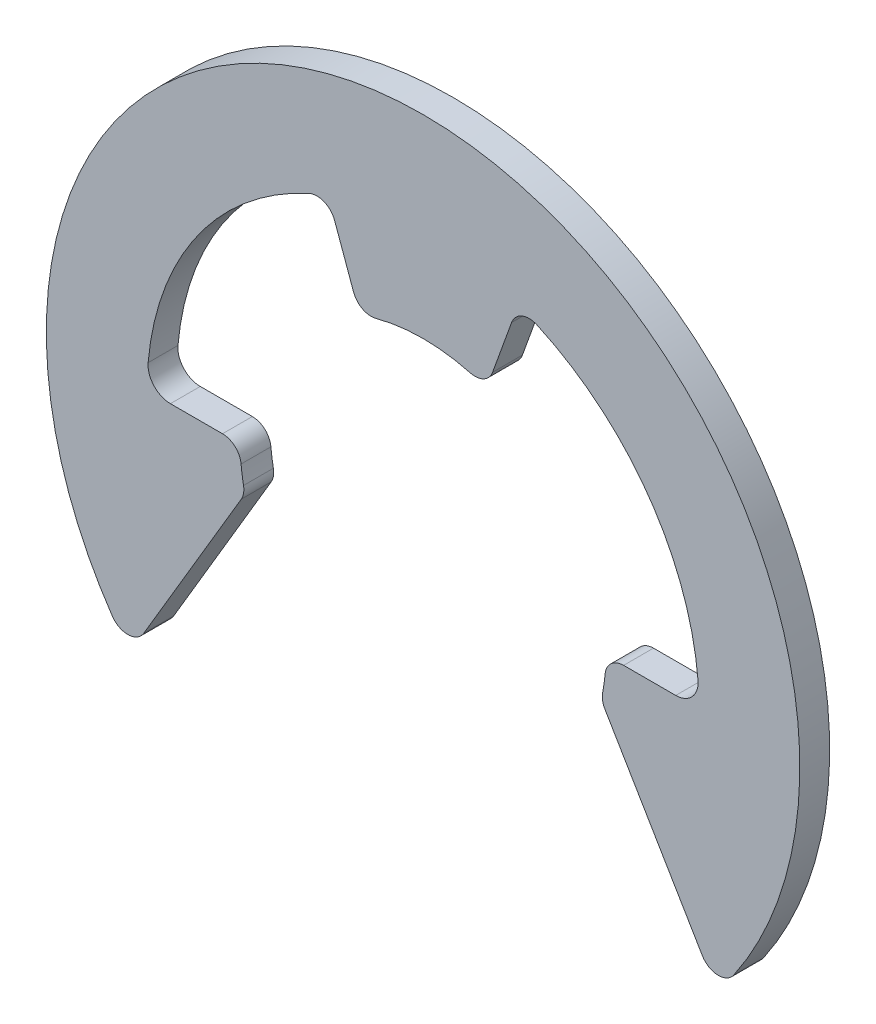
ISO-10303-21;
HEADER;
FILE_DESCRIPTION(('STEP AP214'),'2;1');
FILE_NAME('part.step','',(''),(''),'','','');
FILE_SCHEMA(('AUTOMOTIVE_DESIGN { 1 0 10303 214 1 1 1 1 }'));
ENDSEC;
DATA;
#1=APPLICATION_CONTEXT('core data for automotive mechanical design processes');
#2=APPLICATION_PROTOCOL_DEFINITION('international standard','automotive_design',2000,#1);
#3=PRODUCT_CONTEXT('',#1,'mechanical');
#4=PRODUCT('Part','Part','',(#3));
#5=PRODUCT_RELATED_PRODUCT_CATEGORY('part','',(#4));
#6=PRODUCT_DEFINITION_FORMATION('','',#4);
#7=PRODUCT_DEFINITION_CONTEXT('part definition',#1,'design');
#8=PRODUCT_DEFINITION('design','',#6,#7);
#9=PRODUCT_DEFINITION_SHAPE('','',#8);
#10=(LENGTH_UNIT() NAMED_UNIT(*) SI_UNIT(.MILLI.,.METRE.));
#11=(NAMED_UNIT(*) PLANE_ANGLE_UNIT() SI_UNIT($,.RADIAN.));
#12=(NAMED_UNIT(*) SI_UNIT($,.STERADIAN.) SOLID_ANGLE_UNIT());
#13=UNCERTAINTY_MEASURE_WITH_UNIT(LENGTH_MEASURE(1.E-05),#10,'distance_accuracy_value','');
#14=(GEOMETRIC_REPRESENTATION_CONTEXT(3) GLOBAL_UNCERTAINTY_ASSIGNED_CONTEXT((#13)) GLOBAL_UNIT_ASSIGNED_CONTEXT((#10,
#11,#12)) REPRESENTATION_CONTEXT('',''));
#15=CARTESIAN_POINT('',(0.,0.,0.));
#16=DIRECTION('',(0.,0.,1.));
#17=DIRECTION('',(1.,0.,0.));
#18=AXIS2_PLACEMENT_3D('',#15,#16,#17);
#19=CARTESIAN_POINT('',(0.,0.,-0.4));
#20=DIRECTION('',(0.,0.,1.));
#21=DIRECTION('',(1.,0.,0.));
#22=AXIS2_PLACEMENT_3D('',#19,#20,#21);
#23=CYLINDRICAL_SURFACE('',#22,4.9);
#24=CARTESIAN_POINT('',(0.,0.,0.4));
#25=DIRECTION('',(0.,0.,-1.));
#26=DIRECTION('',(-1.,0.,0.));
#27=AXIS2_PLACEMENT_3D('',#24,#25,#26);
#28=CIRCLE('',#27,4.9);
#29=CARTESIAN_POINT('',(4.87894998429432,-0.453703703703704,0.4));
#30=VERTEX_POINT('',#29);
#31=CARTESIAN_POINT('',(4.81306388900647,-0.91892110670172,0.4));
#32=VERTEX_POINT('',#31);
#33=EDGE_CURVE('E471',#30,#32,#28,.T.);
#34=ORIENTED_EDGE('',*,*,#33,.F.);
#35=DIRECTION('',(0.,0.,1.));
#36=VECTOR('',#35,1.);
#37=CARTESIAN_POINT('',(4.87894998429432,-0.453703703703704,-0.4));
#38=LINE('',#37,#36);
#39=CARTESIAN_POINT('',(4.87894998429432,-0.453703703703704,-0.4));
#40=VERTEX_POINT('',#39);
#41=EDGE_CURVE('E338',#30,#40,#38,.F.);
#42=ORIENTED_EDGE('',*,*,#41,.T.);
#43=CARTESIAN_POINT('',(0.,0.,-0.4));
#44=DIRECTION('',(0.,0.,-1.));
#45=DIRECTION('',(-1.,0.,0.));
#46=AXIS2_PLACEMENT_3D('',#43,#44,#45);
#47=CIRCLE('',#46,4.9);
#48=CARTESIAN_POINT('',(4.81306388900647,-0.91892110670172,-0.4));
#49=VERTEX_POINT('',#48);
#50=EDGE_CURVE('E436',#40,#49,#47,.T.);
#51=ORIENTED_EDGE('',*,*,#50,.T.);
#52=DIRECTION('',(0.,0.,1.));
#53=VECTOR('',#52,1.);
#54=CARTESIAN_POINT('',(4.81306388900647,-0.91892110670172,-0.4));
#55=LINE('',#54,#53);
#56=EDGE_CURVE('E334',#49,#32,#55,.T.);
#57=ORIENTED_EDGE('',*,*,#56,.T.);
#58=EDGE_LOOP('',(#34,#42,#51,#57));
#59=FACE_BOUND('',#58,.T.);
#60=ADVANCED_FACE('F39',(#59),#23,.F.);
#61=CARTESIAN_POINT('',(7.4,0.,-0.4));
#62=DIRECTION('',(0.,1.,0.));
#63=DIRECTION('',(-1.,0.,0.));
#64=AXIS2_PLACEMENT_3D('',#61,#62,#63);
#65=PLANE('',#64);
#66=DIRECTION('',(-1.,0.,0.));
#67=VECTOR('',#66,1.);
#68=CARTESIAN_POINT('',(7.4,0.,-0.4));
#69=LINE('',#68,#67);
#70=CARTESIAN_POINT('',(6.77347768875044,0.,-0.4));
#71=VERTEX_POINT('',#70);
#72=CARTESIAN_POINT('',(5.37680202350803,0.,-0.4));
#73=VERTEX_POINT('',#72);
#74=EDGE_CURVE('E233',#71,#73,#69,.T.);
#75=ORIENTED_EDGE('',*,*,#74,.T.);
#76=DIRECTION('',(0.,0.,1.));
#77=VECTOR('',#76,1.);
#78=CARTESIAN_POINT('',(5.37680202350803,0.,-0.4));
#79=LINE('',#78,#77);
#80=CARTESIAN_POINT('',(5.37680202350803,0.,0.4));
#81=VERTEX_POINT('',#80);
#82=EDGE_CURVE('E312',#73,#81,#79,.T.);
#83=ORIENTED_EDGE('',*,*,#82,.T.);
#84=DIRECTION('',(-1.,0.,0.));
#85=VECTOR('',#84,1.);
#86=CARTESIAN_POINT('',(7.4,0.,0.4));
#87=LINE('',#86,#85);
#88=CARTESIAN_POINT('',(6.77347768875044,0.,0.4));
#89=VERTEX_POINT('',#88);
#90=EDGE_CURVE('E243',#89,#81,#87,.T.);
#91=ORIENTED_EDGE('',*,*,#90,.F.);
#92=DIRECTION('',(0.,0.,-1.));
#93=VECTOR('',#92,1.);
#94=CARTESIAN_POINT('',(6.77347768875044,0.,-0.4));
#95=LINE('',#94,#93);
#96=EDGE_CURVE('E289',#89,#71,#95,.T.);
#97=ORIENTED_EDGE('',*,*,#96,.T.);
#98=EDGE_LOOP('',(#75,#83,#91,#97));
#99=FACE_BOUND('',#98,.T.);
#100=ADVANCED_FACE('F500',(#99),#65,.T.);
#101=CARTESIAN_POINT('',(0.,0.,-0.4));
#102=DIRECTION('',(0.,0.,1.));
#103=DIRECTION('',(1.,0.,0.));
#104=AXIS2_PLACEMENT_3D('',#101,#102,#103);
#105=CYLINDRICAL_SURFACE('',#104,7.4);
#106=CARTESIAN_POINT('',(0.,0.,-0.4));
#107=DIRECTION('',(0.,0.,-1.));
#108=DIRECTION('',(-1.,0.,0.));
#109=AXIS2_PLACEMENT_3D('',#106,#107,#108);
#110=CIRCLE('',#109,7.4);
#111=CARTESIAN_POINT('',(3.04917747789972,6.742589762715,-0.4));
#112=VERTEX_POINT('',#111);
#113=CARTESIAN_POINT('',(7.37113748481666,0.652941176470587,-0.4));
#114=VERTEX_POINT('',#113);
#115=EDGE_CURVE('E240',#112,#114,#110,.T.);
#116=ORIENTED_EDGE('',*,*,#115,.T.);
#117=DIRECTION('',(0.,0.,1.));
#118=VECTOR('',#117,1.);
#119=CARTESIAN_POINT('',(7.37113748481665,0.652941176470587,-0.4));
#120=LINE('',#119,#118);
#121=CARTESIAN_POINT('',(7.37113748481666,0.652941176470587,0.4));
#122=VERTEX_POINT('',#121);
#123=EDGE_CURVE('E285',#114,#122,#120,.T.);
#124=ORIENTED_EDGE('',*,*,#123,.T.);
#125=CARTESIAN_POINT('',(0.,0.,0.4));
#126=DIRECTION('',(0.,0.,-1.));
#127=DIRECTION('',(-1.,0.,0.));
#128=AXIS2_PLACEMENT_3D('',#125,#126,#127);
#129=CIRCLE('',#128,7.4);
#130=CARTESIAN_POINT('',(3.04917747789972,6.742589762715,0.4));
#131=VERTEX_POINT('',#130);
#132=EDGE_CURVE('E214',#131,#122,#129,.T.);
#133=ORIENTED_EDGE('',*,*,#132,.F.);
#134=DIRECTION('',(0.,0.,1.));
#135=VECTOR('',#134,1.);
#136=CARTESIAN_POINT('',(3.04917747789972,6.742589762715,-0.4));
#137=LINE('',#136,#135);
#138=EDGE_CURVE('E223',#131,#112,#137,.F.);
#139=ORIENTED_EDGE('',*,*,#138,.T.);
#140=EDGE_LOOP('',(#116,#124,#133,#139));
#141=FACE_BOUND('',#140,.T.);
#142=ADVANCED_FACE('F505',(#141),#105,.F.);
#143=CARTESIAN_POINT('',(1.7,4.59565011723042,-0.4));
#144=DIRECTION('',(0.940427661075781,-0.33999384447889,0.));
#145=DIRECTION('',(0.33999384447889,0.940427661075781,0.));
#146=AXIS2_PLACEMENT_3D('',#143,#144,#145);
#147=PLANE('',#146);
#148=DIRECTION('',(0.33999384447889,0.940427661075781,0.));
#149=VECTOR('',#148,1.);
#150=CARTESIAN_POINT('',(1.7,4.59565011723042,0.4));
#151=LINE('',#150,#149);
#152=CARTESIAN_POINT('',(1.86325906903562,5.04722695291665,0.4));
#153=VERTEX_POINT('',#152);
#154=CARTESIAN_POINT('',(2.37293814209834,6.45700629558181,0.4));
#155=VERTEX_POINT('',#154);
#156=EDGE_CURVE('E201',#153,#155,#151,.T.);
#157=ORIENTED_EDGE('',*,*,#156,.F.);
#158=DIRECTION('',(0.,0.,1.));
#159=VECTOR('',#158,1.);
#160=CARTESIAN_POINT('',(1.86325906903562,5.04722695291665,-0.4));
#161=LINE('',#160,#159);
#162=CARTESIAN_POINT('',(1.86325906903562,5.04722695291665,-0.4));
#163=VERTEX_POINT('',#162);
#164=EDGE_CURVE('E272',#153,#163,#161,.F.);
#165=ORIENTED_EDGE('',*,*,#164,.T.);
#166=DIRECTION('',(0.33999384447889,0.940427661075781,0.));
#167=VECTOR('',#166,1.);
#168=CARTESIAN_POINT('',(1.7,4.59565011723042,-0.4));
#169=LINE('',#168,#167);
#170=CARTESIAN_POINT('',(2.37293814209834,6.45700629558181,-0.4));
#171=VERTEX_POINT('',#170);
#172=EDGE_CURVE('E230',#163,#171,#169,.T.);
#173=ORIENTED_EDGE('',*,*,#172,.T.);
#174=DIRECTION('',(0.,0.,-1.));
#175=VECTOR('',#174,1.);
#176=CARTESIAN_POINT('',(2.37293814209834,6.45700629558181,0.4));
#177=LINE('',#176,#175);
#178=EDGE_CURVE('E222',#171,#155,#177,.F.);
#179=ORIENTED_EDGE('',*,*,#178,.T.);
#180=EDGE_LOOP('',(#157,#165,#173,#179));
#181=FACE_BOUND('',#180,.T.);
#182=ADVANCED_FACE('F228',(#181),#147,.T.);
#183=CARTESIAN_POINT('',(0.,0.,-0.4));
#184=DIRECTION('',(0.,0.,1.));
#185=DIRECTION('',(1.,0.,0.));
#186=AXIS2_PLACEMENT_3D('',#183,#184,#185);
#187=CYLINDRICAL_SURFACE('',#186,4.9);
#188=CARTESIAN_POINT('',(0.,0.,-0.4));
#189=DIRECTION('',(0.,0.,-1.));
#190=DIRECTION('',(-1.,0.,0.));
#191=AXIS2_PLACEMENT_3D('',#188,#189,#190);
#192=CIRCLE('',#191,4.9);
#193=CARTESIAN_POINT('',(-1.26405956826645,4.73414759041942,-0.4));
#194=VERTEX_POINT('',#193);
#195=CARTESIAN_POINT('',(1.26405956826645,4.73414759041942,-0.4));
#196=VERTEX_POINT('',#195);
#197=EDGE_CURVE('E462',#194,#196,#192,.T.);
#198=ORIENTED_EDGE('',*,*,#197,.T.);
#199=DIRECTION('',(0.,0.,1.));
#200=VECTOR('',#199,1.);
#201=CARTESIAN_POINT('',(1.26405956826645,4.73414759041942,-0.4));
#202=LINE('',#201,#200);
#203=CARTESIAN_POINT('',(1.26405956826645,4.73414759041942,0.4));
#204=VERTEX_POINT('',#203);
#205=EDGE_CURVE('E263',#196,#204,#202,.T.);
#206=ORIENTED_EDGE('',*,*,#205,.T.);
#207=CARTESIAN_POINT('',(0.,0.,0.4));
#208=DIRECTION('',(0.,0.,-1.));
#209=DIRECTION('',(-1.,0.,0.));
#210=AXIS2_PLACEMENT_3D('',#207,#208,#209);
#211=CIRCLE('',#210,4.9);
#212=CARTESIAN_POINT('',(-1.26405956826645,4.73414759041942,0.4));
#213=VERTEX_POINT('',#212);
#214=EDGE_CURVE('E215',#213,#204,#211,.T.);
#215=ORIENTED_EDGE('',*,*,#214,.F.);
#216=DIRECTION('',(0.,0.,1.));
#217=VECTOR('',#216,1.);
#218=CARTESIAN_POINT('',(-1.26405956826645,4.73414759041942,-0.4));
#219=LINE('',#218,#217);
#220=EDGE_CURVE('E260',#213,#194,#219,.F.);
#221=ORIENTED_EDGE('',*,*,#220,.T.);
#222=EDGE_LOOP('',(#198,#206,#215,#221));
#223=FACE_BOUND('',#222,.T.);
#224=ADVANCED_FACE('F594',(#223),#187,.F.);
#225=CARTESIAN_POINT('',(-2.55,6.94676183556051,-0.4));
#226=DIRECTION('',(-0.940427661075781,-0.33999384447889,0.));
#227=DIRECTION('',(0.33999384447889,-0.940427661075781,0.));
#228=AXIS2_PLACEMENT_3D('',#225,#226,#227);
#229=PLANE('',#228);
#230=DIRECTION('',(0.33999384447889,-0.940427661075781,0.));
#231=VECTOR('',#230,1.);
#232=CARTESIAN_POINT('',(-2.55,6.94676183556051,-0.4));
#233=LINE('',#232,#231);
#234=CARTESIAN_POINT('',(-2.37293814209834,6.45700629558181,-0.4));
#235=VERTEX_POINT('',#234);
#236=CARTESIAN_POINT('',(-1.86325906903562,5.04722695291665,-0.4));
#237=VERTEX_POINT('',#236);
#238=EDGE_CURVE('E458',#235,#237,#233,.T.);
#239=ORIENTED_EDGE('',*,*,#238,.T.);
#240=DIRECTION('',(0.,0.,1.));
#241=VECTOR('',#240,1.);
#242=CARTESIAN_POINT('',(-1.86325906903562,5.04722695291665,-0.4));
#243=LINE('',#242,#241);
#244=CARTESIAN_POINT('',(-1.86325906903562,5.04722695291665,0.4));
#245=VERTEX_POINT('',#244);
#246=EDGE_CURVE('E281',#237,#245,#243,.T.);
#247=ORIENTED_EDGE('',*,*,#246,.T.);
#248=DIRECTION('',(0.33999384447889,-0.940427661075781,0.));
#249=VECTOR('',#248,1.);
#250=CARTESIAN_POINT('',(-2.55,6.94676183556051,0.4));
#251=LINE('',#250,#249);
#252=CARTESIAN_POINT('',(-2.37293814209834,6.45700629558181,0.4));
#253=VERTEX_POINT('',#252);
#254=EDGE_CURVE('E429',#253,#245,#251,.T.);
#255=ORIENTED_EDGE('',*,*,#254,.F.);
#256=DIRECTION('',(0.,0.,-1.));
#257=VECTOR('',#256,1.);
#258=CARTESIAN_POINT('',(-2.37293814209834,6.45700629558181,-0.4));
#259=LINE('',#258,#257);
#260=EDGE_CURVE('E226',#253,#235,#259,.T.);
#261=ORIENTED_EDGE('',*,*,#260,.T.);
#262=EDGE_LOOP('',(#239,#247,#255,#261));
#263=FACE_BOUND('',#262,.T.);
#264=ADVANCED_FACE('F587',(#263),#229,.T.);
#265=CARTESIAN_POINT('',(0.,0.,-0.4));
#266=DIRECTION('',(0.,0.,1.));
#267=DIRECTION('',(1.,0.,0.));
#268=AXIS2_PLACEMENT_3D('',#265,#266,#267);
#269=CYLINDRICAL_SURFACE('',#268,7.4);
#270=CARTESIAN_POINT('',(0.,0.,0.4));
#271=DIRECTION('',(0.,0.,-1.));
#272=DIRECTION('',(-1.,0.,0.));
#273=AXIS2_PLACEMENT_3D('',#270,#271,#272);
#274=CIRCLE('',#273,7.4);
#275=CARTESIAN_POINT('',(-7.37113748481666,0.652941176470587,0.4));
#276=VERTEX_POINT('',#275);
#277=CARTESIAN_POINT('',(-3.04917747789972,6.742589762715,0.4));
#278=VERTEX_POINT('',#277);
#279=EDGE_CURVE('E426',#276,#278,#274,.T.);
#280=ORIENTED_EDGE('',*,*,#279,.F.);
#281=DIRECTION('',(0.,0.,1.));
#282=VECTOR('',#281,1.);
#283=CARTESIAN_POINT('',(-7.37113748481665,0.652941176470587,-0.4));
#284=LINE('',#283,#282);
#285=CARTESIAN_POINT('',(-7.37113748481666,0.652941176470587,-0.4));
#286=VERTEX_POINT('',#285);
#287=EDGE_CURVE('E296',#276,#286,#284,.F.);
#288=ORIENTED_EDGE('',*,*,#287,.T.);
#289=CARTESIAN_POINT('',(0.,0.,-0.4));
#290=DIRECTION('',(0.,0.,-1.));
#291=DIRECTION('',(-1.,0.,0.));
#292=AXIS2_PLACEMENT_3D('',#289,#290,#291);
#293=CIRCLE('',#292,7.4);
#294=CARTESIAN_POINT('',(-3.04917747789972,6.742589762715,-0.4));
#295=VERTEX_POINT('',#294);
#296=EDGE_CURVE('E455',#286,#295,#293,.T.);
#297=ORIENTED_EDGE('',*,*,#296,.T.);
#298=DIRECTION('',(0.,0.,1.));
#299=VECTOR('',#298,1.);
#300=CARTESIAN_POINT('',(-3.04917747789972,6.742589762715,-0.4));
#301=LINE('',#300,#299);
#302=EDGE_CURVE('E237',#295,#278,#301,.T.);
#303=ORIENTED_EDGE('',*,*,#302,.T.);
#304=EDGE_LOOP('',(#280,#288,#297,#303));
#305=FACE_BOUND('',#304,.T.);
#306=ADVANCED_FACE('F580',(#305),#269,.F.);
#307=CARTESIAN_POINT('',(-4.9,0.,-0.4));
#308=DIRECTION('',(0.,1.,0.));
#309=DIRECTION('',(-1.,0.,0.));
#310=AXIS2_PLACEMENT_3D('',#307,#308,#309);
#311=PLANE('',#310);
#312=DIRECTION('',(-1.,0.,0.));
#313=VECTOR('',#312,1.);
#314=CARTESIAN_POINT('',(-4.9,0.,0.4));
#315=LINE('',#314,#313);
#316=CARTESIAN_POINT('',(-5.37680202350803,0.,0.4));
#317=VERTEX_POINT('',#316);
#318=CARTESIAN_POINT('',(-6.77347768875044,0.,0.4));
#319=VERTEX_POINT('',#318);
#320=EDGE_CURVE('E418',#317,#319,#315,.T.);
#321=ORIENTED_EDGE('',*,*,#320,.F.);
#322=DIRECTION('',(0.,0.,1.));
#323=VECTOR('',#322,1.);
#324=CARTESIAN_POINT('',(-5.37680202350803,0.,-0.4));
#325=LINE('',#324,#323);
#326=CARTESIAN_POINT('',(-5.37680202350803,0.,-0.4));
#327=VERTEX_POINT('',#326);
#328=EDGE_CURVE('E11',#317,#327,#325,.F.);
#329=ORIENTED_EDGE('',*,*,#328,.T.);
#330=DIRECTION('',(-1.,0.,0.));
#331=VECTOR('',#330,1.);
#332=CARTESIAN_POINT('',(-4.9,0.,-0.4));
#333=LINE('',#332,#331);
#334=CARTESIAN_POINT('',(-6.77347768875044,0.,-0.4));
#335=VERTEX_POINT('',#334);
#336=EDGE_CURVE('E401',#327,#335,#333,.T.);
#337=ORIENTED_EDGE('',*,*,#336,.T.);
#338=DIRECTION('',(0.,0.,-1.));
#339=VECTOR('',#338,1.);
#340=CARTESIAN_POINT('',(-6.77347768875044,0.,0.4));
#341=LINE('',#340,#339);
#342=EDGE_CURVE('E292',#335,#319,#341,.F.);
#343=ORIENTED_EDGE('',*,*,#342,.T.);
#344=EDGE_LOOP('',(#321,#329,#337,#343));
#345=FACE_BOUND('',#344,.T.);
#346=ADVANCED_FACE('F573',(#345),#311,.T.);
#347=CARTESIAN_POINT('',(0.,0.,-0.4));
#348=DIRECTION('',(0.,0.,1.));
#349=DIRECTION('',(1.,0.,0.));
#350=AXIS2_PLACEMENT_3D('',#347,#348,#349);
#351=CYLINDRICAL_SURFACE('',#350,4.9);
#352=CARTESIAN_POINT('',(0.,0.,0.4));
#353=DIRECTION('',(0.,0.,-1.));
#354=DIRECTION('',(-1.,0.,0.));
#355=AXIS2_PLACEMENT_3D('',#352,#353,#354);
#356=CIRCLE('',#355,4.9);
#357=CARTESIAN_POINT('',(-4.81306388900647,-0.91892110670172,0.4));
#358=VERTEX_POINT('',#357);
#359=CARTESIAN_POINT('',(-4.87894998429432,-0.453703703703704,0.4));
#360=VERTEX_POINT('',#359);
#361=EDGE_CURVE('E391',#358,#360,#356,.T.);
#362=ORIENTED_EDGE('',*,*,#361,.F.);
#363=DIRECTION('',(0.,0.,1.));
#364=VECTOR('',#363,1.);
#365=CARTESIAN_POINT('',(-4.81306388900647,-0.91892110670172,-0.4));
#366=LINE('',#365,#364);
#367=CARTESIAN_POINT('',(-4.81306388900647,-0.91892110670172,-0.4));
#368=VERTEX_POINT('',#367);
#369=EDGE_CURVE('E48',#358,#368,#366,.F.);
#370=ORIENTED_EDGE('',*,*,#369,.T.);
#371=CARTESIAN_POINT('',(0.,0.,-0.4));
#372=DIRECTION('',(0.,0.,-1.));
#373=DIRECTION('',(-1.,0.,0.));
#374=AXIS2_PLACEMENT_3D('',#371,#372,#373);
#375=CIRCLE('',#374,4.9);
#376=CARTESIAN_POINT('',(-4.87894998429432,-0.453703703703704,-0.4));
#377=VERTEX_POINT('',#376);
#378=EDGE_CURVE('E388',#368,#377,#375,.T.);
#379=ORIENTED_EDGE('',*,*,#378,.T.);
#380=DIRECTION('',(0.,0.,1.));
#381=VECTOR('',#380,1.);
#382=CARTESIAN_POINT('',(-4.87894998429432,-0.453703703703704,-0.4));
#383=LINE('',#382,#381);
#384=EDGE_CURVE('E378',#377,#360,#383,.T.);
#385=ORIENTED_EDGE('',*,*,#384,.T.);
#386=EDGE_LOOP('',(#362,#370,#379,#385));
#387=FACE_BOUND('',#386,.T.);
#388=ADVANCED_FACE('F387',(#387),#351,.F.);
#389=CARTESIAN_POINT('',(-7.86893040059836,-6.33166126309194,-0.4));
#390=DIRECTION('',(0.860742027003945,-0.509041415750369,0.));
#391=DIRECTION('',(0.509041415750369,0.860742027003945,0.));
#392=AXIS2_PLACEMENT_3D('',#389,#390,#391);
#393=PLANE('',#392);
#394=DIRECTION('',(0.509041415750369,0.860742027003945,0.));
#395=VECTOR('',#394,1.);
#396=CARTESIAN_POINT('',(-7.86893040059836,-6.33166126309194,0.4));
#397=LINE('',#396,#395);
#398=CARTESIAN_POINT('',(-7.48629456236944,-5.68465939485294,0.4));
#399=VERTEX_POINT('',#398);
#400=CARTESIAN_POINT('',(-4.87382184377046,-1.26720927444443,0.4));
#401=VERTEX_POINT('',#400);
#402=EDGE_CURVE('E410',#399,#401,#397,.T.);
#403=ORIENTED_EDGE('',*,*,#402,.F.);
#404=DIRECTION('',(0.,0.,1.));
#405=VECTOR('',#404,1.);
#406=CARTESIAN_POINT('',(-7.48629456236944,-5.68465939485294,-0.4));
#407=LINE('',#406,#405);
#408=CARTESIAN_POINT('',(-7.48629456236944,-5.68465939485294,-0.4));
#409=VERTEX_POINT('',#408);
#410=EDGE_CURVE('E375',#399,#409,#407,.F.);
#411=ORIENTED_EDGE('',*,*,#410,.T.);
#412=DIRECTION('',(0.509041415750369,0.860742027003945,0.));
#413=VECTOR('',#412,1.);
#414=CARTESIAN_POINT('',(-7.86893040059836,-6.33166126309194,-0.4));
#415=LINE('',#414,#413);
#416=CARTESIAN_POINT('',(-4.87382184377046,-1.26720927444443,-0.4));
#417=VERTEX_POINT('',#416);
#418=EDGE_CURVE('E402',#409,#417,#415,.T.);
#419=ORIENTED_EDGE('',*,*,#418,.T.);
#420=DIRECTION('',(0.,0.,1.));
#421=VECTOR('',#420,1.);
#422=CARTESIAN_POINT('',(-4.87382184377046,-1.26720927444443,-0.4));
#423=LINE('',#422,#421);
#424=EDGE_CURVE('E371',#417,#401,#423,.T.);
#425=ORIENTED_EDGE('',*,*,#424,.T.);
#426=EDGE_LOOP('',(#403,#411,#419,#425));
#427=FACE_BOUND('',#426,.T.);
#428=ADVANCED_FACE('F409',(#427),#393,.T.);
#429=CARTESIAN_POINT('',(0.,0.,-0.4));
#430=DIRECTION('',(0.,0.,1.));
#431=DIRECTION('',(1.,0.,0.));
#432=AXIS2_PLACEMENT_3D('',#429,#430,#431);
#433=CYLINDRICAL_SURFACE('',#432,10.1);
#434=CARTESIAN_POINT('',(0.,0.,0.4));
#435=DIRECTION('',(0.,0.,1.));
#436=DIRECTION('',(1.,0.,0.));
#437=AXIS2_PLACEMENT_3D('',#434,#435,#436);
#438=CIRCLE('',#437,10.1);
#439=CARTESIAN_POINT('',(8.32899190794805,-5.71295841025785,0.4));
#440=VERTEX_POINT('',#439);
#441=CARTESIAN_POINT('',(-8.32899190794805,-5.71295841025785,0.4));
#442=VERTEX_POINT('',#441);
#443=EDGE_CURVE('E414',#440,#442,#438,.T.);
#444=ORIENTED_EDGE('',*,*,#443,.F.);
#445=DIRECTION('',(0.,0.,1.));
#446=VECTOR('',#445,1.);
#447=CARTESIAN_POINT('',(8.32899190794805,-5.71295841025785,-0.4));
#448=LINE('',#447,#446);
#449=CARTESIAN_POINT('',(8.32899190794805,-5.71295841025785,-0.4));
#450=VERTEX_POINT('',#449);
#451=EDGE_CURVE('E368',#440,#450,#448,.F.);
#452=ORIENTED_EDGE('',*,*,#451,.T.);
#453=CARTESIAN_POINT('',(0.,0.,-0.4));
#454=DIRECTION('',(0.,0.,1.));
#455=DIRECTION('',(1.,0.,0.));
#456=AXIS2_PLACEMENT_3D('',#453,#454,#455);
#457=CIRCLE('',#456,10.1);
#458=CARTESIAN_POINT('',(-8.32899190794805,-5.71295841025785,-0.4));
#459=VERTEX_POINT('',#458);
#460=EDGE_CURVE('E445',#450,#459,#457,.T.);
#461=ORIENTED_EDGE('',*,*,#460,.T.);
#462=DIRECTION('',(0.,0.,1.));
#463=VECTOR('',#462,1.);
#464=CARTESIAN_POINT('',(-8.32899190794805,-5.71295841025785,-0.4));
#465=LINE('',#464,#463);
#466=EDGE_CURVE('E364',#459,#442,#465,.T.);
#467=ORIENTED_EDGE('',*,*,#466,.T.);
#468=EDGE_LOOP('',(#444,#452,#461,#467));
#469=FACE_BOUND('',#468,.T.);
#470=ADVANCED_FACE('F487',(#469),#433,.T.);
#471=CARTESIAN_POINT('',(4.77493455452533,-1.1,-0.4));
#472=DIRECTION('',(-0.860742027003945,-0.509041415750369,0.));
#473=DIRECTION('',(0.509041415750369,-0.860742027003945,0.));
#474=AXIS2_PLACEMENT_3D('',#471,#472,#473);
#475=PLANE('',#474);
#476=DIRECTION('',(0.509041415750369,-0.860742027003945,0.));
#477=VECTOR('',#476,1.);
#478=CARTESIAN_POINT('',(4.77493455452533,-1.1,0.4));
#479=LINE('',#478,#477);
#480=CARTESIAN_POINT('',(4.87382184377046,-1.26720927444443,0.4));
#481=VERTEX_POINT('',#480);
#482=CARTESIAN_POINT('',(7.48629456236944,-5.68465939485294,0.4));
#483=VERTEX_POINT('',#482);
#484=EDGE_CURVE('E420',#481,#483,#479,.T.);
#485=ORIENTED_EDGE('',*,*,#484,.F.);
#486=DIRECTION('',(0.,0.,1.));
#487=VECTOR('',#486,1.);
#488=CARTESIAN_POINT('',(4.87382184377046,-1.26720927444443,-0.4));
#489=LINE('',#488,#487);
#490=CARTESIAN_POINT('',(4.87382184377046,-1.26720927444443,-0.4));
#491=VERTEX_POINT('',#490);
#492=EDGE_CURVE('E62',#481,#491,#489,.F.);
#493=ORIENTED_EDGE('',*,*,#492,.T.);
#494=DIRECTION('',(0.509041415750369,-0.860742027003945,0.));
#495=VECTOR('',#494,1.);
#496=CARTESIAN_POINT('',(4.77493455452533,-1.1,-0.4));
#497=LINE('',#496,#495);
#498=CARTESIAN_POINT('',(7.48629456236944,-5.68465939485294,-0.4));
#499=VERTEX_POINT('',#498);
#500=EDGE_CURVE('E440',#491,#499,#497,.T.);
#501=ORIENTED_EDGE('',*,*,#500,.T.);
#502=DIRECTION('',(0.,0.,1.));
#503=VECTOR('',#502,1.);
#504=CARTESIAN_POINT('',(7.48629456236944,-5.68465939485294,-0.4));
#505=LINE('',#504,#503);
#506=EDGE_CURVE('E358',#499,#483,#505,.T.);
#507=ORIENTED_EDGE('',*,*,#506,.T.);
#508=EDGE_LOOP('',(#485,#493,#501,#507));
#509=FACE_BOUND('',#508,.T.);
#510=ADVANCED_FACE('F477',(#509),#475,.T.);
#511=CARTESIAN_POINT('',(0.,0.,-0.4));
#512=DIRECTION('',(0.,0.,-1.));
#513=DIRECTION('',(-1.,0.,0.));
#514=AXIS2_PLACEMENT_3D('',#511,#512,#513);
#515=PLANE('',#514);
#516=ORIENTED_EDGE('',*,*,#50,.F.);
#517=CARTESIAN_POINT('',(5.37680202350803,-0.500000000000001,-0.4));
#518=DIRECTION('',(0.,0.,-1.));
#519=DIRECTION('',(-1.,0.,0.));
#520=AXIS2_PLACEMENT_3D('',#517,#518,#519);
#521=CIRCLE('',#520,0.5);
#522=EDGE_CURVE('E355',#40,#73,#521,.T.);
#523=ORIENTED_EDGE('',*,*,#522,.T.);
#524=ORIENTED_EDGE('',*,*,#74,.F.);
#525=CARTESIAN_POINT('',(6.77347768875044,0.599999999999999,-0.4));
#526=DIRECTION('',(0.,0.,-1.));
#527=DIRECTION('',(-1.,0.,0.));
#528=AXIS2_PLACEMENT_3D('',#525,#526,#527);
#529=CIRCLE('',#528,0.6);
#530=EDGE_CURVE('E302',#71,#114,#529,.F.);
#531=ORIENTED_EDGE('',*,*,#530,.T.);
#532=ORIENTED_EDGE('',*,*,#115,.F.);
#533=CARTESIAN_POINT('',(2.84315197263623,6.28700937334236,-0.4));
#534=DIRECTION('',(0.,0.,-1.));
#535=DIRECTION('',(-1.,0.,0.));
#536=AXIS2_PLACEMENT_3D('',#533,#534,#535);
#537=CIRCLE('',#536,0.5);
#538=EDGE_CURVE('E225',#112,#171,#537,.F.);
#539=ORIENTED_EDGE('',*,*,#538,.T.);
#540=ORIENTED_EDGE('',*,*,#172,.F.);
#541=CARTESIAN_POINT('',(1.39304523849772,5.2172238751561,-0.4));
#542=DIRECTION('',(0.,0.,-1.));
#543=DIRECTION('',(-1.,0.,0.));
#544=AXIS2_PLACEMENT_3D('',#541,#542,#543);
#545=CIRCLE('',#544,0.5);
#546=EDGE_CURVE('E278',#163,#196,#545,.T.);
#547=ORIENTED_EDGE('',*,*,#546,.T.);
#548=ORIENTED_EDGE('',*,*,#197,.F.);
#549=CARTESIAN_POINT('',(-1.39304523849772,5.2172238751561,-0.4));
#550=DIRECTION('',(0.,0.,-1.));
#551=DIRECTION('',(-1.,0.,0.));
#552=AXIS2_PLACEMENT_3D('',#549,#550,#551);
#553=CIRCLE('',#552,0.5);
#554=EDGE_CURVE('E275',#194,#237,#553,.T.);
#555=ORIENTED_EDGE('',*,*,#554,.T.);
#556=ORIENTED_EDGE('',*,*,#238,.F.);
#557=CARTESIAN_POINT('',(-2.84315197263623,6.28700937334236,-0.4));
#558=DIRECTION('',(0.,0.,-1.));
#559=DIRECTION('',(-1.,0.,0.));
#560=AXIS2_PLACEMENT_3D('',#557,#558,#559);
#561=CIRCLE('',#560,0.5);
#562=EDGE_CURVE('E256',#235,#295,#561,.F.);
#563=ORIENTED_EDGE('',*,*,#562,.T.);
#564=ORIENTED_EDGE('',*,*,#296,.F.);
#565=CARTESIAN_POINT('',(-6.77347768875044,0.599999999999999,-0.4));
#566=DIRECTION('',(0.,0.,-1.));
#567=DIRECTION('',(-1.,0.,0.));
#568=AXIS2_PLACEMENT_3D('',#565,#566,#567);
#569=CIRCLE('',#568,0.6);
#570=EDGE_CURVE('E308',#286,#335,#569,.F.);
#571=ORIENTED_EDGE('',*,*,#570,.T.);
#572=ORIENTED_EDGE('',*,*,#336,.F.);
#573=CARTESIAN_POINT('',(-5.37680202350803,-0.500000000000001,-0.4));
#574=DIRECTION('',(0.,0.,-1.));
#575=DIRECTION('',(-1.,0.,0.));
#576=AXIS2_PLACEMENT_3D('',#573,#574,#575);
#577=CIRCLE('',#576,0.5);
#578=EDGE_CURVE('E341',#327,#377,#577,.T.);
#579=ORIENTED_EDGE('',*,*,#578,.T.);
#580=ORIENTED_EDGE('',*,*,#378,.F.);
#581=CARTESIAN_POINT('',(-5.30419285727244,-1.01268856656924,-0.4));
#582=DIRECTION('',(0.,0.,-1.));
#583=DIRECTION('',(-1.,0.,0.));
#584=AXIS2_PLACEMENT_3D('',#581,#582,#583);
#585=CIRCLE('',#584,0.5);
#586=EDGE_CURVE('E344',#368,#417,#585,.T.);
#587=ORIENTED_EDGE('',*,*,#586,.T.);
#588=ORIENTED_EDGE('',*,*,#418,.F.);
#589=CARTESIAN_POINT('',(-7.91666557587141,-5.43013868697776,-0.4));
#590=DIRECTION('',(0.,0.,-1.));
#591=DIRECTION('',(-1.,0.,0.));
#592=AXIS2_PLACEMENT_3D('',#589,#590,#591);
#593=CIRCLE('',#592,0.5);
#594=EDGE_CURVE('E347',#409,#459,#593,.T.);
#595=ORIENTED_EDGE('',*,*,#594,.T.);
#596=ORIENTED_EDGE('',*,*,#460,.F.);
#597=CARTESIAN_POINT('',(7.91666557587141,-5.43013868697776,-0.4));
#598=DIRECTION('',(0.,0.,-1.));
#599=DIRECTION('',(-1.,0.,0.));
#600=AXIS2_PLACEMENT_3D('',#597,#598,#599);
#601=CIRCLE('',#600,0.5);
#602=EDGE_CURVE('E55',#450,#499,#601,.T.);
#603=ORIENTED_EDGE('',*,*,#602,.T.);
#604=ORIENTED_EDGE('',*,*,#500,.F.);
#605=CARTESIAN_POINT('',(5.30419285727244,-1.01268856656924,-0.4));
#606=DIRECTION('',(0.,0.,-1.));
#607=DIRECTION('',(-1.,0.,0.));
#608=AXIS2_PLACEMENT_3D('',#605,#606,#607);
#609=CIRCLE('',#608,0.5);
#610=EDGE_CURVE('E352',#491,#49,#609,.T.);
#611=ORIENTED_EDGE('',*,*,#610,.T.);
#612=EDGE_LOOP('',(#516,#523,#524,#531,#532,#539,#540,#547,#548,#555,#556,#563,#564,#571,#572,
#579,#580,#587,#588,#595,#596,#603,#604,#611));
#613=FACE_BOUND('',#612,.T.);
#614=ADVANCED_FACE('F395',(#613),#515,.T.);
#615=CARTESIAN_POINT('',(0.,0.,0.4));
#616=DIRECTION('',(0.,0.,-1.));
#617=DIRECTION('',(-1.,0.,0.));
#618=AXIS2_PLACEMENT_3D('',#615,#616,#617);
#619=PLANE('',#618);
#620=ORIENTED_EDGE('',*,*,#90,.T.);
#621=CARTESIAN_POINT('',(5.37680202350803,-0.500000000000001,0.4));
#622=DIRECTION('',(0.,0.,-1.));
#623=DIRECTION('',(-1.,0.,0.));
#624=AXIS2_PLACEMENT_3D('',#621,#622,#623);
#625=CIRCLE('',#624,0.5);
#626=EDGE_CURVE('E331',#81,#30,#625,.F.);
#627=ORIENTED_EDGE('',*,*,#626,.T.);
#628=ORIENTED_EDGE('',*,*,#33,.T.);
#629=CARTESIAN_POINT('',(5.30419285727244,-1.01268856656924,0.4));
#630=DIRECTION('',(0.,0.,-1.));
#631=DIRECTION('',(-1.,0.,0.));
#632=AXIS2_PLACEMENT_3D('',#629,#630,#631);
#633=CIRCLE('',#632,0.5);
#634=EDGE_CURVE('E328',#32,#481,#633,.F.);
#635=ORIENTED_EDGE('',*,*,#634,.T.);
#636=ORIENTED_EDGE('',*,*,#484,.T.);
#637=CARTESIAN_POINT('',(7.91666557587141,-5.43013868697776,0.4));
#638=DIRECTION('',(0.,0.,-1.));
#639=DIRECTION('',(-1.,0.,0.));
#640=AXIS2_PLACEMENT_3D('',#637,#638,#639);
#641=CIRCLE('',#640,0.5);
#642=EDGE_CURVE('E325',#483,#440,#641,.F.);
#643=ORIENTED_EDGE('',*,*,#642,.T.);
#644=ORIENTED_EDGE('',*,*,#443,.T.);
#645=CARTESIAN_POINT('',(-7.91666557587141,-5.43013868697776,0.4));
#646=DIRECTION('',(0.,0.,-1.));
#647=DIRECTION('',(-1.,0.,0.));
#648=AXIS2_PLACEMENT_3D('',#645,#646,#647);
#649=CIRCLE('',#648,0.5);
#650=EDGE_CURVE('E322',#442,#399,#649,.F.);
#651=ORIENTED_EDGE('',*,*,#650,.T.);
#652=ORIENTED_EDGE('',*,*,#402,.T.);
#653=CARTESIAN_POINT('',(-5.30419285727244,-1.01268856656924,0.4));
#654=DIRECTION('',(0.,0.,-1.));
#655=DIRECTION('',(-1.,0.,0.));
#656=AXIS2_PLACEMENT_3D('',#653,#654,#655);
#657=CIRCLE('',#656,0.5);
#658=EDGE_CURVE('E319',#401,#358,#657,.F.);
#659=ORIENTED_EDGE('',*,*,#658,.T.);
#660=ORIENTED_EDGE('',*,*,#361,.T.);
#661=CARTESIAN_POINT('',(-5.37680202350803,-0.500000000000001,0.4));
#662=DIRECTION('',(0.,0.,-1.));
#663=DIRECTION('',(-1.,0.,0.));
#664=AXIS2_PLACEMENT_3D('',#661,#662,#663);
#665=CIRCLE('',#664,0.5);
#666=EDGE_CURVE('E316',#360,#317,#665,.F.);
#667=ORIENTED_EDGE('',*,*,#666,.T.);
#668=ORIENTED_EDGE('',*,*,#320,.T.);
#669=CARTESIAN_POINT('',(-6.77347768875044,0.599999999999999,0.4));
#670=DIRECTION('',(0.,0.,-1.));
#671=DIRECTION('',(-1.,0.,0.));
#672=AXIS2_PLACEMENT_3D('',#669,#670,#671);
#673=CIRCLE('',#672,0.6);
#674=EDGE_CURVE('E305',#319,#276,#673,.T.);
#675=ORIENTED_EDGE('',*,*,#674,.T.);
#676=ORIENTED_EDGE('',*,*,#279,.T.);
#677=CARTESIAN_POINT('',(-2.84315197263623,6.28700937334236,0.4));
#678=DIRECTION('',(0.,0.,-1.));
#679=DIRECTION('',(-1.,0.,0.));
#680=AXIS2_PLACEMENT_3D('',#677,#678,#679);
#681=CIRCLE('',#680,0.5);
#682=EDGE_CURVE('E253',#278,#253,#681,.T.);
#683=ORIENTED_EDGE('',*,*,#682,.T.);
#684=ORIENTED_EDGE('',*,*,#254,.T.);
#685=CARTESIAN_POINT('',(-1.39304523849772,5.2172238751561,0.4));
#686=DIRECTION('',(0.,0.,-1.));
#687=DIRECTION('',(-1.,0.,0.));
#688=AXIS2_PLACEMENT_3D('',#685,#686,#687);
#689=CIRCLE('',#688,0.5);
#690=EDGE_CURVE('E267',#245,#213,#689,.F.);
#691=ORIENTED_EDGE('',*,*,#690,.T.);
#692=ORIENTED_EDGE('',*,*,#214,.T.);
#693=CARTESIAN_POINT('',(1.39304523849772,5.2172238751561,0.4));
#694=DIRECTION('',(0.,0.,-1.));
#695=DIRECTION('',(-1.,0.,0.));
#696=AXIS2_PLACEMENT_3D('',#693,#694,#695);
#697=CIRCLE('',#696,0.5);
#698=EDGE_CURVE('E209',#204,#153,#697,.F.);
#699=ORIENTED_EDGE('',*,*,#698,.T.);
#700=ORIENTED_EDGE('',*,*,#156,.T.);
#701=CARTESIAN_POINT('',(2.84315197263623,6.28700937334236,0.4));
#702=DIRECTION('',(0.,0.,-1.));
#703=DIRECTION('',(-1.,0.,0.));
#704=AXIS2_PLACEMENT_3D('',#701,#702,#703);
#705=CIRCLE('',#704,0.5);
#706=EDGE_CURVE('E206',#155,#131,#705,.T.);
#707=ORIENTED_EDGE('',*,*,#706,.T.);
#708=ORIENTED_EDGE('',*,*,#132,.T.);
#709=CARTESIAN_POINT('',(6.77347768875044,0.599999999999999,0.4));
#710=DIRECTION('',(0.,0.,-1.));
#711=DIRECTION('',(-1.,0.,0.));
#712=AXIS2_PLACEMENT_3D('',#709,#710,#711);
#713=CIRCLE('',#712,0.6);
#714=EDGE_CURVE('E299',#122,#89,#713,.T.);
#715=ORIENTED_EDGE('',*,*,#714,.T.);
#716=EDGE_LOOP('',(#620,#627,#628,#635,#636,#643,#644,#651,#652,#659,#660,#667,#668,#675,#676,
#683,#684,#691,#692,#699,#700,#707,#708,#715));
#717=FACE_BOUND('',#716,.T.);
#718=ADVANCED_FACE('F204',(#717),#619,.F.);
#719=CARTESIAN_POINT('',(2.84315197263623,6.28700937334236,-0.4));
#720=DIRECTION('',(0.,0.,1.));
#721=DIRECTION('',(1.,0.,0.));
#722=AXIS2_PLACEMENT_3D('',#719,#720,#721);
#723=CYLINDRICAL_SURFACE('',#722,0.5);
#724=ORIENTED_EDGE('',*,*,#538,.F.);
#725=ORIENTED_EDGE('',*,*,#138,.F.);
#726=ORIENTED_EDGE('',*,*,#706,.F.);
#727=ORIENTED_EDGE('',*,*,#178,.F.);
#728=EDGE_LOOP('',(#724,#725,#726,#727));
#729=FACE_BOUND('',#728,.T.);
#730=ADVANCED_FACE('F221',(#729),#723,.F.);
#731=CARTESIAN_POINT('',(-2.84315197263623,6.28700937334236,-0.4));
#732=DIRECTION('',(0.,0.,1.));
#733=DIRECTION('',(1.,0.,0.));
#734=AXIS2_PLACEMENT_3D('',#731,#732,#733);
#735=CYLINDRICAL_SURFACE('',#734,0.5);
#736=ORIENTED_EDGE('',*,*,#562,.F.);
#737=ORIENTED_EDGE('',*,*,#260,.F.);
#738=ORIENTED_EDGE('',*,*,#682,.F.);
#739=ORIENTED_EDGE('',*,*,#302,.F.);
#740=EDGE_LOOP('',(#736,#737,#738,#739));
#741=FACE_BOUND('',#740,.T.);
#742=ADVANCED_FACE('F514',(#741),#735,.F.);
#743=CARTESIAN_POINT('',(1.39304523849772,5.2172238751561,-0.4));
#744=DIRECTION('',(0.,0.,1.));
#745=DIRECTION('',(1.,0.,0.));
#746=AXIS2_PLACEMENT_3D('',#743,#744,#745);
#747=CYLINDRICAL_SURFACE('',#746,0.5);
#748=ORIENTED_EDGE('',*,*,#546,.F.);
#749=ORIENTED_EDGE('',*,*,#164,.F.);
#750=ORIENTED_EDGE('',*,*,#698,.F.);
#751=ORIENTED_EDGE('',*,*,#205,.F.);
#752=EDGE_LOOP('',(#748,#749,#750,#751));
#753=FACE_BOUND('',#752,.T.);
#754=ADVANCED_FACE('F517',(#753),#747,.T.);
#755=CARTESIAN_POINT('',(-1.39304523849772,5.2172238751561,-0.4));
#756=DIRECTION('',(0.,0.,1.));
#757=DIRECTION('',(1.,0.,0.));
#758=AXIS2_PLACEMENT_3D('',#755,#756,#757);
#759=CYLINDRICAL_SURFACE('',#758,0.5);
#760=ORIENTED_EDGE('',*,*,#554,.F.);
#761=ORIENTED_EDGE('',*,*,#220,.F.);
#762=ORIENTED_EDGE('',*,*,#690,.F.);
#763=ORIENTED_EDGE('',*,*,#246,.F.);
#764=EDGE_LOOP('',(#760,#761,#762,#763));
#765=FACE_BOUND('',#764,.T.);
#766=ADVANCED_FACE('F521',(#765),#759,.T.);
#767=CARTESIAN_POINT('',(6.77347768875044,0.599999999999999,-0.4));
#768=DIRECTION('',(0.,0.,1.));
#769=DIRECTION('',(1.,0.,0.));
#770=AXIS2_PLACEMENT_3D('',#767,#768,#769);
#771=CYLINDRICAL_SURFACE('',#770,0.6);
#772=ORIENTED_EDGE('',*,*,#530,.F.);
#773=ORIENTED_EDGE('',*,*,#96,.F.);
#774=ORIENTED_EDGE('',*,*,#714,.F.);
#775=ORIENTED_EDGE('',*,*,#123,.F.);
#776=EDGE_LOOP('',(#772,#773,#774,#775));
#777=FACE_BOUND('',#776,.T.);
#778=ADVANCED_FACE('F525',(#777),#771,.F.);
#779=CARTESIAN_POINT('',(-6.77347768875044,0.599999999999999,-0.4));
#780=DIRECTION('',(0.,0.,1.));
#781=DIRECTION('',(1.,0.,0.));
#782=AXIS2_PLACEMENT_3D('',#779,#780,#781);
#783=CYLINDRICAL_SURFACE('',#782,0.6);
#784=ORIENTED_EDGE('',*,*,#570,.F.);
#785=ORIENTED_EDGE('',*,*,#287,.F.);
#786=ORIENTED_EDGE('',*,*,#674,.F.);
#787=ORIENTED_EDGE('',*,*,#342,.F.);
#788=EDGE_LOOP('',(#784,#785,#786,#787));
#789=FACE_BOUND('',#788,.T.);
#790=ADVANCED_FACE('F529',(#789),#783,.F.);
#791=CARTESIAN_POINT('',(5.37680202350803,-0.500000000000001,-0.4));
#792=DIRECTION('',(0.,0.,1.));
#793=DIRECTION('',(1.,0.,0.));
#794=AXIS2_PLACEMENT_3D('',#791,#792,#793);
#795=CYLINDRICAL_SURFACE('',#794,0.5);
#796=ORIENTED_EDGE('',*,*,#522,.F.);
#797=ORIENTED_EDGE('',*,*,#41,.F.);
#798=ORIENTED_EDGE('',*,*,#626,.F.);
#799=ORIENTED_EDGE('',*,*,#82,.F.);
#800=EDGE_LOOP('',(#796,#797,#798,#799));
#801=FACE_BOUND('',#800,.T.);
#802=ADVANCED_FACE('F533',(#801),#795,.T.);
#803=CARTESIAN_POINT('',(5.30419285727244,-1.01268856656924,-0.4));
#804=DIRECTION('',(0.,0.,1.));
#805=DIRECTION('',(1.,0.,0.));
#806=AXIS2_PLACEMENT_3D('',#803,#804,#805);
#807=CYLINDRICAL_SURFACE('',#806,0.5);
#808=ORIENTED_EDGE('',*,*,#610,.F.);
#809=ORIENTED_EDGE('',*,*,#492,.F.);
#810=ORIENTED_EDGE('',*,*,#634,.F.);
#811=ORIENTED_EDGE('',*,*,#56,.F.);
#812=EDGE_LOOP('',(#808,#809,#810,#811));
#813=FACE_BOUND('',#812,.T.);
#814=ADVANCED_FACE('F481',(#813),#807,.T.);
#815=CARTESIAN_POINT('',(7.91666557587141,-5.43013868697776,-0.4));
#816=DIRECTION('',(0.,0.,1.));
#817=DIRECTION('',(1.,0.,0.));
#818=AXIS2_PLACEMENT_3D('',#815,#816,#817);
#819=CYLINDRICAL_SURFACE('',#818,0.5);
#820=ORIENTED_EDGE('',*,*,#602,.F.);
#821=ORIENTED_EDGE('',*,*,#451,.F.);
#822=ORIENTED_EDGE('',*,*,#642,.F.);
#823=ORIENTED_EDGE('',*,*,#506,.F.);
#824=EDGE_LOOP('',(#820,#821,#822,#823));
#825=FACE_BOUND('',#824,.T.);
#826=ADVANCED_FACE('F484',(#825),#819,.T.);
#827=CARTESIAN_POINT('',(-7.91666557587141,-5.43013868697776,-0.4));
#828=DIRECTION('',(0.,0.,1.));
#829=DIRECTION('',(1.,0.,0.));
#830=AXIS2_PLACEMENT_3D('',#827,#828,#829);
#831=CYLINDRICAL_SURFACE('',#830,0.5);
#832=ORIENTED_EDGE('',*,*,#594,.F.);
#833=ORIENTED_EDGE('',*,*,#410,.F.);
#834=ORIENTED_EDGE('',*,*,#650,.F.);
#835=ORIENTED_EDGE('',*,*,#466,.F.);
#836=EDGE_LOOP('',(#832,#833,#834,#835));
#837=FACE_BOUND('',#836,.T.);
#838=ADVANCED_FACE('F491',(#837),#831,.T.);
#839=CARTESIAN_POINT('',(-5.30419285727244,-1.01268856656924,-0.4));
#840=DIRECTION('',(0.,0.,1.));
#841=DIRECTION('',(1.,0.,0.));
#842=AXIS2_PLACEMENT_3D('',#839,#840,#841);
#843=CYLINDRICAL_SURFACE('',#842,0.5);
#844=ORIENTED_EDGE('',*,*,#586,.F.);
#845=ORIENTED_EDGE('',*,*,#369,.F.);
#846=ORIENTED_EDGE('',*,*,#658,.F.);
#847=ORIENTED_EDGE('',*,*,#424,.F.);
#848=EDGE_LOOP('',(#844,#845,#846,#847));
#849=FACE_BOUND('',#848,.T.);
#850=ADVANCED_FACE('F405',(#849),#843,.T.);
#851=CARTESIAN_POINT('',(-5.37680202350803,-0.500000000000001,-0.4));
#852=DIRECTION('',(0.,0.,1.));
#853=DIRECTION('',(1.,0.,0.));
#854=AXIS2_PLACEMENT_3D('',#851,#852,#853);
#855=CYLINDRICAL_SURFACE('',#854,0.5);
#856=ORIENTED_EDGE('',*,*,#578,.F.);
#857=ORIENTED_EDGE('',*,*,#328,.F.);
#858=ORIENTED_EDGE('',*,*,#666,.F.);
#859=ORIENTED_EDGE('',*,*,#384,.F.);
#860=EDGE_LOOP('',(#856,#857,#858,#859));
#861=FACE_BOUND('',#860,.T.);
#862=ADVANCED_FACE('F41',(#861),#855,.T.);
#863=CLOSED_SHELL('',(#60,#100,#142,#182,#224,#264,#306,#346,#388,#428,#470,#510,#614,#718,#730,
#742,#754,#766,#778,#790,#802,#814,#826,#838,#850,#862));
#864=MANIFOLD_SOLID_BREP('B2',#863);
#865=ADVANCED_BREP_SHAPE_REPRESENTATION('',(#18,#864),#14);
#866=SHAPE_DEFINITION_REPRESENTATION(#9,#865);
ENDSEC;
END-ISO-10303-21;
